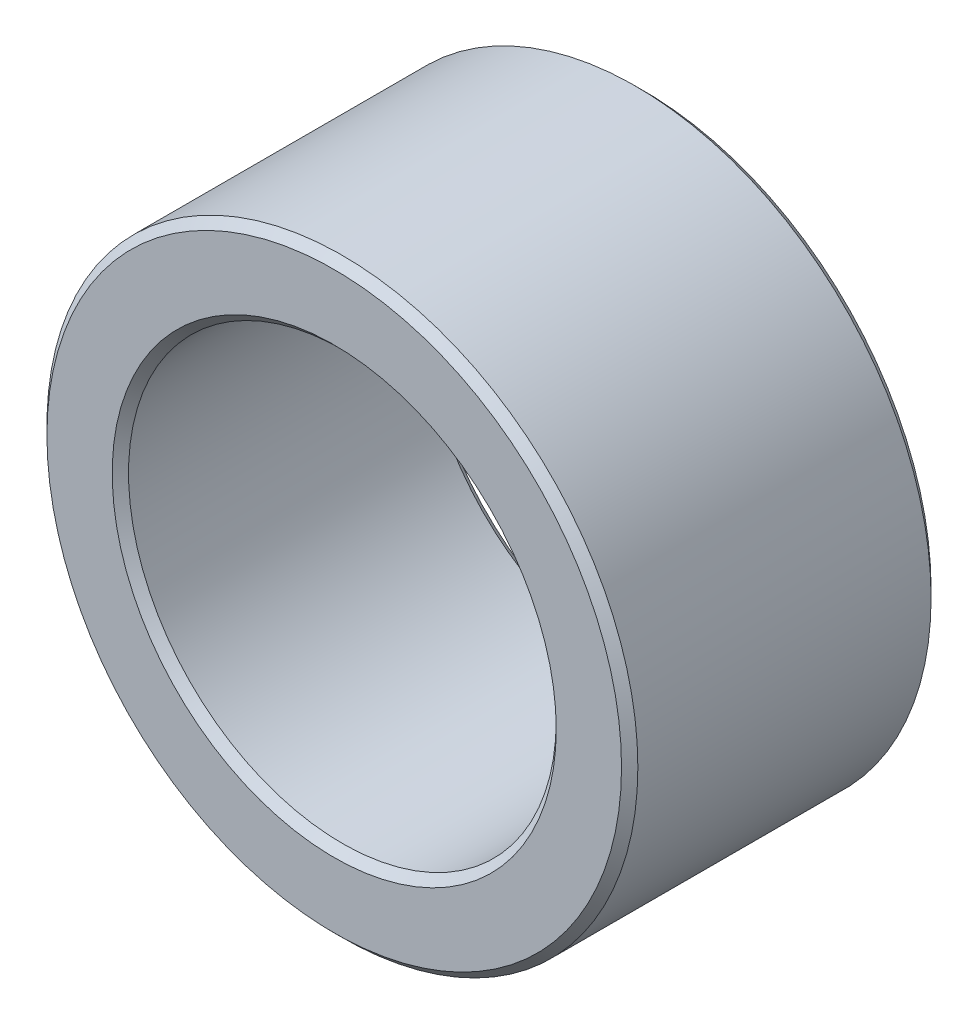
from build123d import *

# Parameters (mm, degrees)
BOSS_EXTRUDE1_DEPTH      = 3.4925
BOSS_EXTRUDE1_DEPTH_BACK = 3.4925
SKETCH3_R                = 6.6675
SKETCH3_R_2              = 4.826
CHAMFER1_SIZE            = 0.18415


with BuildPart() as part:
    # Sketch3 → Boss-Extrude1 (new, two sides: drawn at the far end of the back side and taken through both)
    with BuildSketch(Plane.XY.offset(-BOSS_EXTRUDE1_DEPTH_BACK)):
        Circle(SKETCH3_R)
        Circle(SKETCH3_R_2, mode=Mode.SUBTRACT)
    extrude(amount=BOSS_EXTRUDE1_DEPTH + BOSS_EXTRUDE1_DEPTH_BACK)

    # Chamfer1
    chamfer1_edges = [part.edges().sort_by_distance(p)[0] for p in [
        (-6.6675, 0, -3.4925),
        (-4.826, 0, -3.4925),
        (-6.6675, 0, 3.4925),
        (-4.826, 0, 3.4925),
    ]]
    chamfer(chamfer1_edges, length=CHAMFER1_SIZE)


solid = part.part
